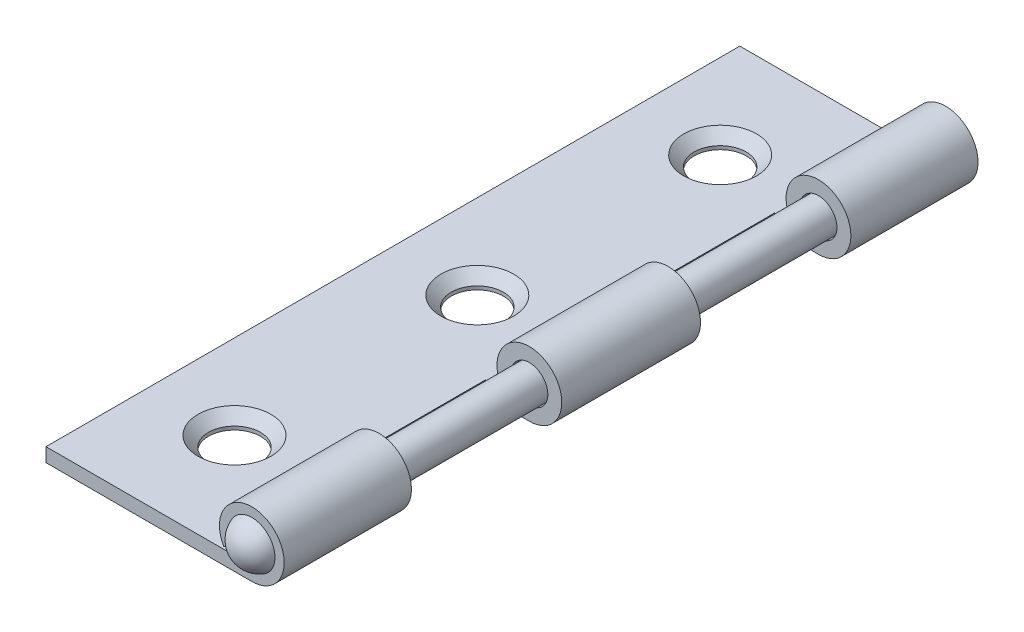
ISO-10303-21;
HEADER;
FILE_DESCRIPTION(('STEP AP214'),'2;1');
FILE_NAME('part.step','',(''),(''),'','','');
FILE_SCHEMA(('AUTOMOTIVE_DESIGN { 1 0 10303 214 1 1 1 1 }'));
ENDSEC;
DATA;
#1=APPLICATION_CONTEXT('core data for automotive mechanical design processes');
#2=APPLICATION_PROTOCOL_DEFINITION('international standard','automotive_design',2000,#1);
#3=PRODUCT_CONTEXT('',#1,'mechanical');
#4=PRODUCT('Part','Part','',(#3));
#5=PRODUCT_RELATED_PRODUCT_CATEGORY('part','',(#4));
#6=PRODUCT_DEFINITION_FORMATION('','',#4);
#7=PRODUCT_DEFINITION_CONTEXT('part definition',#1,'design');
#8=PRODUCT_DEFINITION('design','',#6,#7);
#9=PRODUCT_DEFINITION_SHAPE('','',#8);
#10=(LENGTH_UNIT() NAMED_UNIT(*) SI_UNIT(.MILLI.,.METRE.));
#11=(NAMED_UNIT(*) PLANE_ANGLE_UNIT() SI_UNIT($,.RADIAN.));
#12=(NAMED_UNIT(*) SI_UNIT($,.STERADIAN.) SOLID_ANGLE_UNIT());
#13=UNCERTAINTY_MEASURE_WITH_UNIT(LENGTH_MEASURE(1.E-05),#10,'distance_accuracy_value','');
#14=(GEOMETRIC_REPRESENTATION_CONTEXT(3) GLOBAL_UNCERTAINTY_ASSIGNED_CONTEXT((#13)) GLOBAL_UNIT_ASSIGNED_CONTEXT((#10,
#11,#12)) REPRESENTATION_CONTEXT('',''));
#15=CARTESIAN_POINT('',(0.,0.,0.));
#16=DIRECTION('',(0.,0.,1.));
#17=DIRECTION('',(1.,0.,0.));
#18=AXIS2_PLACEMENT_3D('',#15,#16,#17);
#19=CARTESIAN_POINT('',(0.,0.,-29.3456896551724));
#20=DIRECTION('',(0.,0.,-1.));
#21=DIRECTION('',(1.,0.,0.));
#22=AXIS2_PLACEMENT_3D('',#19,#20,#21);
#23=SPHERICAL_SURFACE('',#22,2.10431034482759);
#24=CARTESIAN_POINT('',(0.,0.,-30.));
#25=DIRECTION('',(0.,0.,-1.));
#26=DIRECTION('',(-1.,0.,0.));
#27=AXIS2_PLACEMENT_3D('',#24,#25,#26);
#28=CIRCLE('',#27,2.);
#29=CARTESIAN_POINT('',(-2.,0.,-30.));
#30=VERTEX_POINT('',#29);
#31=EDGE_CURVE('E11',#30,#30,#28,.T.);
#32=ORIENTED_EDGE('',*,*,#31,.T.);
#33=EDGE_LOOP('',(#32));
#34=FACE_BOUND('',#33,.T.);
#35=ADVANCED_FACE('F42',(#34),#23,.T.);
#36=CARTESIAN_POINT('',(-1.49999999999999,0.,-30.));
#37=DIRECTION('',(0.,0.,1.));
#38=DIRECTION('',(1.,0.,0.));
#39=AXIS2_PLACEMENT_3D('',#36,#37,#38);
#40=PLANE('',#39);
#41=CARTESIAN_POINT('',(0.,0.,-30.));
#42=DIRECTION('',(0.,0.,-1.));
#43=DIRECTION('',(-1.,0.,0.));
#44=AXIS2_PLACEMENT_3D('',#41,#42,#43);
#45=CIRCLE('',#44,1.49999999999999);
#46=CARTESIAN_POINT('',(-1.49999999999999,0.,-30.));
#47=VERTEX_POINT('',#46);
#48=EDGE_CURVE('E48',#47,#47,#45,.T.);
#49=ORIENTED_EDGE('',*,*,#48,.T.);
#50=EDGE_LOOP('',(#49));
#51=FACE_BOUND('',#50,.T.);
#52=ORIENTED_EDGE('',*,*,#31,.F.);
#53=EDGE_LOOP('',(#52));
#54=FACE_BOUND('',#53,.T.);
#55=ADVANCED_FACE('F74',(#51,#54),#40,.T.);
#56=CARTESIAN_POINT('',(0.,0.,-88.99));
#57=DIRECTION('',(0.,0.,-1.));
#58=DIRECTION('',(-1.,0.,0.));
#59=AXIS2_PLACEMENT_3D('',#56,#57,#58);
#60=CYLINDRICAL_SURFACE('',#59,1.49999999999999);
#61=CARTESIAN_POINT('',(0.,0.,30.));
#62=DIRECTION('',(0.,0.,-1.));
#63=DIRECTION('',(-1.,0.,0.));
#64=AXIS2_PLACEMENT_3D('',#61,#62,#63);
#65=CIRCLE('',#64,1.49999999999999);
#66=CARTESIAN_POINT('',(-1.49999999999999,0.,30.));
#67=VERTEX_POINT('',#66);
#68=EDGE_CURVE('E52',#67,#67,#65,.T.);
#69=ORIENTED_EDGE('',*,*,#68,.T.);
#70=EDGE_LOOP('',(#69));
#71=FACE_BOUND('',#70,.T.);
#72=ORIENTED_EDGE('',*,*,#48,.F.);
#73=EDGE_LOOP('',(#72));
#74=FACE_BOUND('',#73,.T.);
#75=ADVANCED_FACE('F71',(#71,#74),#60,.T.);
#76=CARTESIAN_POINT('',(-2.,0.,30.));
#77=DIRECTION('',(0.,0.,-1.));
#78=DIRECTION('',(-1.,0.,0.));
#79=AXIS2_PLACEMENT_3D('',#76,#77,#78);
#80=PLANE('',#79);
#81=CARTESIAN_POINT('',(0.,0.,30.));
#82=DIRECTION('',(0.,0.,-1.));
#83=DIRECTION('',(-1.,0.,0.));
#84=AXIS2_PLACEMENT_3D('',#81,#82,#83);
#85=CIRCLE('',#84,2.);
#86=CARTESIAN_POINT('',(-2.,0.,30.));
#87=VERTEX_POINT('',#86);
#88=EDGE_CURVE('E56',#87,#87,#85,.T.);
#89=ORIENTED_EDGE('',*,*,#88,.T.);
#90=EDGE_LOOP('',(#89));
#91=FACE_BOUND('',#90,.T.);
#92=ORIENTED_EDGE('',*,*,#68,.F.);
#93=EDGE_LOOP('',(#92));
#94=FACE_BOUND('',#93,.T.);
#95=ADVANCED_FACE('F62',(#91,#94),#80,.T.);
#96=CARTESIAN_POINT('',(0.,0.,29.3456896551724));
#97=DIRECTION('',(0.,0.,-1.));
#98=DIRECTION('',(-1.,0.,0.));
#99=AXIS2_PLACEMENT_3D('',#96,#97,#98);
#100=SPHERICAL_SURFACE('',#99,2.1043103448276);
#101=ORIENTED_EDGE('',*,*,#88,.F.);
#102=EDGE_LOOP('',(#101));
#103=FACE_BOUND('',#102,.T.);
#104=ADVANCED_FACE('F65',(#103),#100,.T.);
#105=CLOSED_SHELL('',(#35,#55,#75,#95,#104));
#106=MANIFOLD_SOLID_BREP('B2',#105);
#107=CARTESIAN_POINT('',(0.,0.,30.));
#108=DIRECTION('',(0.,0.,-1.));
#109=DIRECTION('',(-1.,0.,0.));
#110=AXIS2_PLACEMENT_3D('',#107,#108,#109);
#111=CYLINDRICAL_SURFACE('',#110,1.6);
#112=DIRECTION('',(0.,0.,-1.));
#113=VECTOR('',#112,1.);
#114=CARTESIAN_POINT('',(0.,-1.6,30.));
#115=LINE('',#114,#113);
#116=CARTESIAN_POINT('',(0.,-1.6,6.));
#117=VERTEX_POINT('',#116);
#118=CARTESIAN_POINT('',(0.,-1.6,-6.00000000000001));
#119=VERTEX_POINT('',#118);
#120=EDGE_CURVE('E369',#117,#119,#115,.T.);
#121=ORIENTED_EDGE('',*,*,#120,.F.);
#122=CARTESIAN_POINT('',(0.,0.,6.));
#123=DIRECTION('',(0.,0.,-1.));
#124=DIRECTION('',(-1.,0.,0.));
#125=AXIS2_PLACEMENT_3D('',#122,#123,#124);
#126=CIRCLE('',#125,1.6);
#127=CARTESIAN_POINT('',(-1.3856406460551,-0.800000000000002,6.));
#128=VERTEX_POINT('',#127);
#129=EDGE_CURVE('E265',#117,#128,#126,.F.);
#130=ORIENTED_EDGE('',*,*,#129,.T.);
#131=DIRECTION('',(0.,0.,-1.));
#132=VECTOR('',#131,1.);
#133=CARTESIAN_POINT('',(-1.3856406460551,-0.800000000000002,30.));
#134=LINE('',#133,#132);
#135=CARTESIAN_POINT('',(-1.3856406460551,-0.800000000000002,-6.00000000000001));
#136=VERTEX_POINT('',#135);
#137=EDGE_CURVE('E135',#128,#136,#134,.T.);
#138=ORIENTED_EDGE('',*,*,#137,.T.);
#139=CARTESIAN_POINT('',(0.,0.,-6.00000000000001));
#140=DIRECTION('',(0.,0.,1.));
#141=DIRECTION('',(1.,0.,0.));
#142=AXIS2_PLACEMENT_3D('',#139,#140,#141);
#143=CIRCLE('',#142,1.6);
#144=EDGE_CURVE('E288',#136,#119,#143,.F.);
#145=ORIENTED_EDGE('',*,*,#144,.T.);
#146=EDGE_LOOP('',(#121,#130,#138,#145));
#147=FACE_BOUND('',#146,.T.);
#148=ADVANCED_FACE('F112',(#147),#111,.F.);
#149=CARTESIAN_POINT('',(0.,0.,30.));
#150=DIRECTION('',(0.,0.,-1.));
#151=DIRECTION('',(-1.,0.,0.));
#152=AXIS2_PLACEMENT_3D('',#149,#150,#151);
#153=CYLINDRICAL_SURFACE('',#152,2.8);
#154=DIRECTION('',(0.,0.,-1.));
#155=VECTOR('',#154,1.);
#156=CARTESIAN_POINT('',(-2.42487113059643,-1.4,30.));
#157=LINE('',#156,#155);
#158=CARTESIAN_POINT('',(-2.42487113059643,-1.4,6.));
#159=VERTEX_POINT('',#158);
#160=CARTESIAN_POINT('',(-2.42487113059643,-1.4,-6.00000000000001));
#161=VERTEX_POINT('',#160);
#162=EDGE_CURVE('E355',#159,#161,#157,.T.);
#163=ORIENTED_EDGE('',*,*,#162,.F.);
#164=CARTESIAN_POINT('',(0.,0.,6.));
#165=DIRECTION('',(0.,0.,-1.));
#166=DIRECTION('',(-1.,0.,0.));
#167=AXIS2_PLACEMENT_3D('',#164,#165,#166);
#168=CIRCLE('',#167,2.8);
#169=CARTESIAN_POINT('',(0.,-2.8,6.));
#170=VERTEX_POINT('',#169);
#171=EDGE_CURVE('E266',#159,#170,#168,.T.);
#172=ORIENTED_EDGE('',*,*,#171,.T.);
#173=DIRECTION('',(0.,0.,-1.));
#174=VECTOR('',#173,1.);
#175=CARTESIAN_POINT('',(0.,-2.8,30.));
#176=LINE('',#175,#174);
#177=CARTESIAN_POINT('',(0.,-2.8,-6.00000000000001));
#178=VERTEX_POINT('',#177);
#179=EDGE_CURVE('E262',#170,#178,#176,.T.);
#180=ORIENTED_EDGE('',*,*,#179,.T.);
#181=CARTESIAN_POINT('',(0.,0.,-6.00000000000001));
#182=DIRECTION('',(0.,0.,1.));
#183=DIRECTION('',(1.,0.,0.));
#184=AXIS2_PLACEMENT_3D('',#181,#182,#183);
#185=CIRCLE('',#184,2.8);
#186=EDGE_CURVE('E281',#178,#161,#185,.T.);
#187=ORIENTED_EDGE('',*,*,#186,.T.);
#188=EDGE_LOOP('',(#163,#172,#180,#187));
#189=FACE_BOUND('',#188,.T.);
#190=ADVANCED_FACE('F403',(#189),#153,.T.);
#191=CARTESIAN_POINT('',(-1.3856406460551,-0.800000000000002,30.));
#192=DIRECTION('',(-0.500000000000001,0.866025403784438,0.));
#193=DIRECTION('',(-0.866025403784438,-0.500000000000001,0.));
#194=AXIS2_PLACEMENT_3D('',#191,#192,#193);
#195=PLANE('',#194);
#196=ORIENTED_EDGE('',*,*,#137,.F.);
#197=DIRECTION('',(-0.866025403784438,-0.500000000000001,0.));
#198=VECTOR('',#197,1.);
#199=CARTESIAN_POINT('',(-1.3856406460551,-0.800000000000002,6.));
#200=LINE('',#199,#198);
#201=EDGE_CURVE('E120',#128,#159,#200,.T.);
#202=ORIENTED_EDGE('',*,*,#201,.T.);
#203=ORIENTED_EDGE('',*,*,#162,.T.);
#204=DIRECTION('',(0.866025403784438,0.500000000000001,0.));
#205=VECTOR('',#204,1.);
#206=CARTESIAN_POINT('',(-1.3856406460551,-0.800000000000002,-6.00000000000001));
#207=LINE('',#206,#205);
#208=EDGE_CURVE('E387',#161,#136,#207,.T.);
#209=ORIENTED_EDGE('',*,*,#208,.T.);
#210=EDGE_LOOP('',(#196,#202,#203,#209));
#211=FACE_BOUND('',#210,.T.);
#212=ADVANCED_FACE('F400',(#211),#195,.F.);
#213=CARTESIAN_POINT('',(0.,-1.6,-19.));
#214=VERTEX_POINT('',#213);
#215=CARTESIAN_POINT('',(0.,-1.6,-30.));
#216=VERTEX_POINT('',#215);
#217=EDGE_CURVE('E364',#214,#216,#115,.T.);
#218=ORIENTED_EDGE('',*,*,#217,.F.);
#219=CARTESIAN_POINT('',(0.,0.,-19.));
#220=DIRECTION('',(0.,0.,-1.));
#221=DIRECTION('',(-1.,0.,0.));
#222=AXIS2_PLACEMENT_3D('',#219,#220,#221);
#223=CIRCLE('',#222,1.6);
#224=CARTESIAN_POINT('',(-1.3856406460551,-0.800000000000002,-19.));
#225=VERTEX_POINT('',#224);
#226=EDGE_CURVE('E299',#214,#225,#223,.F.);
#227=ORIENTED_EDGE('',*,*,#226,.T.);
#228=CARTESIAN_POINT('',(-1.3856406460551,-0.800000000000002,-30.));
#229=VERTEX_POINT('',#228);
#230=EDGE_CURVE('E332',#225,#229,#134,.T.);
#231=ORIENTED_EDGE('',*,*,#230,.T.);
#232=CARTESIAN_POINT('',(0.,0.,-30.));
#233=DIRECTION('',(0.,0.,-1.));
#234=DIRECTION('',(1.,0.,0.));
#235=AXIS2_PLACEMENT_3D('',#232,#233,#234);
#236=CIRCLE('',#235,1.6);
#237=EDGE_CURVE('E317',#229,#216,#236,.T.);
#238=ORIENTED_EDGE('',*,*,#237,.T.);
#239=EDGE_LOOP('',(#218,#227,#231,#238));
#240=FACE_BOUND('',#239,.T.);
#241=ADVANCED_FACE('F422',(#240),#111,.F.);
#242=CARTESIAN_POINT('',(-2.42487113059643,-1.4,-19.));
#243=VERTEX_POINT('',#242);
#244=CARTESIAN_POINT('',(-2.42487113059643,-1.4,-30.));
#245=VERTEX_POINT('',#244);
#246=EDGE_CURVE('E350',#243,#245,#157,.T.);
#247=ORIENTED_EDGE('',*,*,#246,.F.);
#248=CARTESIAN_POINT('',(0.,0.,-19.));
#249=DIRECTION('',(0.,0.,-1.));
#250=DIRECTION('',(-1.,0.,0.));
#251=AXIS2_PLACEMENT_3D('',#248,#249,#250);
#252=CIRCLE('',#251,2.8);
#253=CARTESIAN_POINT('',(0.,-2.8,-19.));
#254=VERTEX_POINT('',#253);
#255=EDGE_CURVE('E293',#243,#254,#252,.T.);
#256=ORIENTED_EDGE('',*,*,#255,.T.);
#257=CARTESIAN_POINT('',(0.,-2.8,-30.));
#258=VERTEX_POINT('',#257);
#259=EDGE_CURVE('E354',#254,#258,#176,.T.);
#260=ORIENTED_EDGE('',*,*,#259,.T.);
#261=CARTESIAN_POINT('',(0.,0.,-30.));
#262=DIRECTION('',(0.,0.,1.));
#263=DIRECTION('',(1.,0.,0.));
#264=AXIS2_PLACEMENT_3D('',#261,#262,#263);
#265=CIRCLE('',#264,2.8);
#266=EDGE_CURVE('E342',#258,#245,#265,.T.);
#267=ORIENTED_EDGE('',*,*,#266,.T.);
#268=EDGE_LOOP('',(#247,#256,#260,#267));
#269=FACE_BOUND('',#268,.T.);
#270=ADVANCED_FACE('F413',(#269),#153,.T.);
#271=ORIENTED_EDGE('',*,*,#230,.F.);
#272=DIRECTION('',(-0.866025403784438,-0.500000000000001,0.));
#273=VECTOR('',#272,1.);
#274=CARTESIAN_POINT('',(-1.3856406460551,-0.800000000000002,-19.));
#275=LINE('',#274,#273);
#276=EDGE_CURVE('E390',#225,#243,#275,.T.);
#277=ORIENTED_EDGE('',*,*,#276,.T.);
#278=ORIENTED_EDGE('',*,*,#246,.T.);
#279=DIRECTION('',(0.866025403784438,0.500000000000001,0.));
#280=VECTOR('',#279,1.);
#281=CARTESIAN_POINT('',(-1.3856406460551,-0.800000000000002,-30.));
#282=LINE('',#281,#280);
#283=EDGE_CURVE('E322',#245,#229,#282,.T.);
#284=ORIENTED_EDGE('',*,*,#283,.T.);
#285=EDGE_LOOP('',(#271,#277,#278,#284));
#286=FACE_BOUND('',#285,.T.);
#287=ADVANCED_FACE('F408',(#286),#195,.F.);
#288=CARTESIAN_POINT('',(-1.3856406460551,-0.800000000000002,30.));
#289=VERTEX_POINT('',#288);
#290=CARTESIAN_POINT('',(-1.3856406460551,-0.800000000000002,19.));
#291=VERTEX_POINT('',#290);
#292=EDGE_CURVE('E347',#289,#291,#134,.T.);
#293=ORIENTED_EDGE('',*,*,#292,.T.);
#294=CARTESIAN_POINT('',(0.,0.,19.));
#295=DIRECTION('',(0.,0.,1.));
#296=DIRECTION('',(1.,0.,0.));
#297=AXIS2_PLACEMENT_3D('',#294,#295,#296);
#298=CIRCLE('',#297,1.6);
#299=CARTESIAN_POINT('',(0.,-1.6,19.));
#300=VERTEX_POINT('',#299);
#301=EDGE_CURVE('E127',#291,#300,#298,.F.);
#302=ORIENTED_EDGE('',*,*,#301,.T.);
#303=CARTESIAN_POINT('',(0.,-1.6,30.));
#304=VERTEX_POINT('',#303);
#305=EDGE_CURVE('E365',#304,#300,#115,.T.);
#306=ORIENTED_EDGE('',*,*,#305,.F.);
#307=CARTESIAN_POINT('',(0.,0.,30.));
#308=DIRECTION('',(0.,0.,-1.));
#309=DIRECTION('',(1.,0.,0.));
#310=AXIS2_PLACEMENT_3D('',#307,#308,#309);
#311=CIRCLE('',#310,1.6);
#312=EDGE_CURVE('E318',#289,#304,#311,.T.);
#313=ORIENTED_EDGE('',*,*,#312,.F.);
#314=EDGE_LOOP('',(#293,#302,#306,#313));
#315=FACE_BOUND('',#314,.T.);
#316=ADVANCED_FACE('F447',(#315),#111,.F.);
#317=CARTESIAN_POINT('',(0.,-1.6,30.));
#318=DIRECTION('',(0.,-1.,0.));
#319=DIRECTION('',(1.,0.,0.));
#320=AXIS2_PLACEMENT_3D('',#317,#318,#319);
#321=PLANE('',#320);
#322=CARTESIAN_POINT('',(-10.5,-1.6,21.));
#323=DIRECTION('',(0.,-1.,0.));
#324=DIRECTION('',(1.,0.,0.));
#325=AXIS2_PLACEMENT_3D('',#322,#323,#324);
#326=CIRCLE('',#325,3.15000000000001);
#327=CARTESIAN_POINT('',(-7.34999999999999,-1.6,21.));
#328=VERTEX_POINT('',#327);
#329=EDGE_CURVE('E375',#328,#328,#326,.T.);
#330=ORIENTED_EDGE('',*,*,#329,.T.);
#331=EDGE_LOOP('',(#330));
#332=FACE_BOUND('',#331,.T.);
#333=CARTESIAN_POINT('',(-10.5,-1.6,0.));
#334=DIRECTION('',(0.,-1.,0.));
#335=DIRECTION('',(1.,0.,0.));
#336=AXIS2_PLACEMENT_3D('',#333,#334,#335);
#337=CIRCLE('',#336,3.15000000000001);
#338=CARTESIAN_POINT('',(-7.34999999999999,-1.6,0.));
#339=VERTEX_POINT('',#338);
#340=EDGE_CURVE('E372',#339,#339,#337,.T.);
#341=ORIENTED_EDGE('',*,*,#340,.T.);
#342=EDGE_LOOP('',(#341));
#343=FACE_BOUND('',#342,.T.);
#344=CARTESIAN_POINT('',(-10.5,-1.6,-21.));
#345=DIRECTION('',(0.,-1.,0.));
#346=DIRECTION('',(1.,0.,0.));
#347=AXIS2_PLACEMENT_3D('',#344,#345,#346);
#348=CIRCLE('',#347,3.15000000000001);
#349=CARTESIAN_POINT('',(-7.34999999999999,-1.6,-21.));
#350=VERTEX_POINT('',#349);
#351=EDGE_CURVE('E368',#350,#350,#348,.T.);
#352=ORIENTED_EDGE('',*,*,#351,.T.);
#353=EDGE_LOOP('',(#352));
#354=FACE_BOUND('',#353,.T.);
#355=DIRECTION('',(0.,0.,-1.));
#356=VECTOR('',#355,1.);
#357=CARTESIAN_POINT('',(-3.8,-1.6,30.));
#358=LINE('',#357,#356);
#359=CARTESIAN_POINT('',(-3.8,-1.6,19.));
#360=VERTEX_POINT('',#359);
#361=CARTESIAN_POINT('',(-3.8,-1.6,6.));
#362=VERTEX_POINT('',#361);
#363=EDGE_CURVE('E254',#360,#362,#358,.T.);
#364=ORIENTED_EDGE('',*,*,#363,.T.);
#365=DIRECTION('',(1.,0.,0.));
#366=VECTOR('',#365,1.);
#367=CARTESIAN_POINT('',(0.,-1.6,6.));
#368=LINE('',#367,#366);
#369=EDGE_CURVE('E268',#362,#117,#368,.T.);
#370=ORIENTED_EDGE('',*,*,#369,.T.);
#371=ORIENTED_EDGE('',*,*,#120,.T.);
#372=DIRECTION('',(-1.,0.,0.));
#373=VECTOR('',#372,1.);
#374=CARTESIAN_POINT('',(0.,-1.6,-6.00000000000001));
#375=LINE('',#374,#373);
#376=CARTESIAN_POINT('',(-3.8,-1.6,-6.));
#377=VERTEX_POINT('',#376);
#378=EDGE_CURVE('E290',#119,#377,#375,.T.);
#379=ORIENTED_EDGE('',*,*,#378,.T.);
#380=DIRECTION('',(0.,0.,-1.));
#381=VECTOR('',#380,1.);
#382=CARTESIAN_POINT('',(-3.8,-1.6,30.));
#383=LINE('',#382,#381);
#384=CARTESIAN_POINT('',(-3.8,-1.6,-19.));
#385=VERTEX_POINT('',#384);
#386=EDGE_CURVE('E305',#377,#385,#383,.T.);
#387=ORIENTED_EDGE('',*,*,#386,.T.);
#388=DIRECTION('',(1.,0.,0.));
#389=VECTOR('',#388,1.);
#390=CARTESIAN_POINT('',(0.,-1.6,-19.));
#391=LINE('',#390,#389);
#392=EDGE_CURVE('E302',#385,#214,#391,.T.);
#393=ORIENTED_EDGE('',*,*,#392,.T.);
#394=ORIENTED_EDGE('',*,*,#217,.T.);
#395=DIRECTION('',(-1.,0.,0.));
#396=VECTOR('',#395,1.);
#397=CARTESIAN_POINT('',(0.,-1.6,-30.));
#398=LINE('',#397,#396);
#399=CARTESIAN_POINT('',(-17.8,-1.6,-30.));
#400=VERTEX_POINT('',#399);
#401=EDGE_CURVE('E335',#216,#400,#398,.T.);
#402=ORIENTED_EDGE('',*,*,#401,.T.);
#403=DIRECTION('',(0.,0.,-1.));
#404=VECTOR('',#403,1.);
#405=CARTESIAN_POINT('',(-17.8,-1.6,30.));
#406=LINE('',#405,#404);
#407=CARTESIAN_POINT('',(-17.8,-1.6,30.));
#408=VERTEX_POINT('',#407);
#409=EDGE_CURVE('E361',#408,#400,#406,.T.);
#410=ORIENTED_EDGE('',*,*,#409,.F.);
#411=DIRECTION('',(-1.,0.,0.));
#412=VECTOR('',#411,1.);
#413=CARTESIAN_POINT('',(0.,-1.6,30.));
#414=LINE('',#413,#412);
#415=EDGE_CURVE('E321',#304,#408,#414,.T.);
#416=ORIENTED_EDGE('',*,*,#415,.F.);
#417=ORIENTED_EDGE('',*,*,#305,.T.);
#418=DIRECTION('',(-1.,0.,0.));
#419=VECTOR('',#418,1.);
#420=CARTESIAN_POINT('',(0.,-1.6,19.));
#421=LINE('',#420,#419);
#422=EDGE_CURVE('E270',#300,#360,#421,.T.);
#423=ORIENTED_EDGE('',*,*,#422,.T.);
#424=EDGE_LOOP('',(#364,#370,#371,#379,#387,#393,#394,#402,#410,#416,#417,#423));
#425=FACE_BOUND('',#424,.T.);
#426=ADVANCED_FACE('F427',(#332,#343,#354,#425),#321,.F.);
#427=CARTESIAN_POINT('',(-17.8,-2.8,30.));
#428=DIRECTION('',(1.,0.,0.));
#429=DIRECTION('',(0.,1.,0.));
#430=AXIS2_PLACEMENT_3D('',#427,#428,#429);
#431=PLANE('',#430);
#432=DIRECTION('',(0.,-1.,0.));
#433=VECTOR('',#432,1.);
#434=CARTESIAN_POINT('',(-17.8,-2.8,-30.));
#435=LINE('',#434,#433);
#436=CARTESIAN_POINT('',(-17.8,-2.8,-30.));
#437=VERTEX_POINT('',#436);
#438=EDGE_CURVE('E337',#400,#437,#435,.T.);
#439=ORIENTED_EDGE('',*,*,#438,.T.);
#440=DIRECTION('',(0.,0.,-1.));
#441=VECTOR('',#440,1.);
#442=CARTESIAN_POINT('',(-17.8,-2.8,30.));
#443=LINE('',#442,#441);
#444=CARTESIAN_POINT('',(-17.8,-2.8,30.));
#445=VERTEX_POINT('',#444);
#446=EDGE_CURVE('E358',#445,#437,#443,.T.);
#447=ORIENTED_EDGE('',*,*,#446,.F.);
#448=DIRECTION('',(0.,-1.,0.));
#449=VECTOR('',#448,1.);
#450=CARTESIAN_POINT('',(-17.8,-2.8,30.));
#451=LINE('',#450,#449);
#452=EDGE_CURVE('E324',#408,#445,#451,.T.);
#453=ORIENTED_EDGE('',*,*,#452,.F.);
#454=ORIENTED_EDGE('',*,*,#409,.T.);
#455=EDGE_LOOP('',(#439,#447,#453,#454));
#456=FACE_BOUND('',#455,.T.);
#457=ADVANCED_FACE('F437',(#456),#431,.F.);
#458=CARTESIAN_POINT('',(0.,-2.8,30.));
#459=DIRECTION('',(0.,1.,0.));
#460=DIRECTION('',(-1.,0.,0.));
#461=AXIS2_PLACEMENT_3D('',#458,#459,#460);
#462=PLANE('',#461);
#463=CARTESIAN_POINT('',(-10.5,-2.8,-21.));
#464=DIRECTION('',(0.,1.,0.));
#465=DIRECTION('',(0.,0.,1.));
#466=AXIS2_PLACEMENT_3D('',#463,#464,#465);
#467=CIRCLE('',#466,2.25);
#468=CARTESIAN_POINT('',(-10.5,-2.8,-18.75));
#469=VERTEX_POINT('',#468);
#470=EDGE_CURVE('E308',#469,#469,#467,.T.);
#471=ORIENTED_EDGE('',*,*,#470,.T.);
#472=EDGE_LOOP('',(#471));
#473=FACE_BOUND('',#472,.T.);
#474=CARTESIAN_POINT('',(-10.5,-2.8,21.));
#475=DIRECTION('',(0.,1.,0.));
#476=DIRECTION('',(0.,0.,1.));
#477=AXIS2_PLACEMENT_3D('',#474,#475,#476);
#478=CIRCLE('',#477,2.25);
#479=CARTESIAN_POINT('',(-10.5,-2.8,23.25));
#480=VERTEX_POINT('',#479);
#481=EDGE_CURVE('E311',#480,#480,#478,.T.);
#482=ORIENTED_EDGE('',*,*,#481,.T.);
#483=EDGE_LOOP('',(#482));
#484=FACE_BOUND('',#483,.T.);
#485=CARTESIAN_POINT('',(-10.5,-2.8,0.));
#486=DIRECTION('',(0.,1.,0.));
#487=DIRECTION('',(0.,0.,1.));
#488=AXIS2_PLACEMENT_3D('',#485,#486,#487);
#489=CIRCLE('',#488,2.25);
#490=CARTESIAN_POINT('',(-10.5,-2.8,2.25));
#491=VERTEX_POINT('',#490);
#492=EDGE_CURVE('E314',#491,#491,#489,.T.);
#493=ORIENTED_EDGE('',*,*,#492,.T.);
#494=EDGE_LOOP('',(#493));
#495=FACE_BOUND('',#494,.T.);
#496=ORIENTED_EDGE('',*,*,#179,.F.);
#497=DIRECTION('',(-1.,0.,0.));
#498=VECTOR('',#497,1.);
#499=CARTESIAN_POINT('',(0.,-2.8,6.));
#500=LINE('',#499,#498);
#501=CARTESIAN_POINT('',(-3.8,-2.8,6.));
#502=VERTEX_POINT('',#501);
#503=EDGE_CURVE('E260',#170,#502,#500,.T.);
#504=ORIENTED_EDGE('',*,*,#503,.T.);
#505=DIRECTION('',(0.,0.,1.));
#506=VECTOR('',#505,1.);
#507=CARTESIAN_POINT('',(-3.8,-2.8,30.));
#508=LINE('',#507,#506);
#509=CARTESIAN_POINT('',(-3.8,-2.8,19.));
#510=VERTEX_POINT('',#509);
#511=EDGE_CURVE('E40',#502,#510,#508,.T.);
#512=ORIENTED_EDGE('',*,*,#511,.T.);
#513=DIRECTION('',(1.,0.,0.));
#514=VECTOR('',#513,1.);
#515=CARTESIAN_POINT('',(0.,-2.8,19.));
#516=LINE('',#515,#514);
#517=CARTESIAN_POINT('',(0.,-2.8,19.));
#518=VERTEX_POINT('',#517);
#519=EDGE_CURVE('E238',#510,#518,#516,.T.);
#520=ORIENTED_EDGE('',*,*,#519,.T.);
#521=CARTESIAN_POINT('',(0.,-2.8,30.));
#522=VERTEX_POINT('',#521);
#523=EDGE_CURVE('E356',#522,#518,#176,.T.);
#524=ORIENTED_EDGE('',*,*,#523,.F.);
#525=DIRECTION('',(1.,0.,0.));
#526=VECTOR('',#525,1.);
#527=CARTESIAN_POINT('',(0.,-2.8,30.));
#528=LINE('',#527,#526);
#529=EDGE_CURVE('E326',#445,#522,#528,.T.);
#530=ORIENTED_EDGE('',*,*,#529,.F.);
#531=ORIENTED_EDGE('',*,*,#446,.T.);
#532=DIRECTION('',(1.,0.,0.));
#533=VECTOR('',#532,1.);
#534=CARTESIAN_POINT('',(0.,-2.8,-30.));
#535=LINE('',#534,#533);
#536=EDGE_CURVE('E339',#437,#258,#535,.T.);
#537=ORIENTED_EDGE('',*,*,#536,.T.);
#538=ORIENTED_EDGE('',*,*,#259,.F.);
#539=DIRECTION('',(-1.,0.,0.));
#540=VECTOR('',#539,1.);
#541=CARTESIAN_POINT('',(0.,-2.8,-19.));
#542=LINE('',#541,#540);
#543=CARTESIAN_POINT('',(-3.8,-2.8,-19.));
#544=VERTEX_POINT('',#543);
#545=EDGE_CURVE('E296',#254,#544,#542,.T.);
#546=ORIENTED_EDGE('',*,*,#545,.T.);
#547=DIRECTION('',(0.,0.,1.));
#548=VECTOR('',#547,1.);
#549=CARTESIAN_POINT('',(-3.8,-2.8,30.));
#550=LINE('',#549,#548);
#551=CARTESIAN_POINT('',(-3.8,-2.8,-6.));
#552=VERTEX_POINT('',#551);
#553=EDGE_CURVE('E393',#544,#552,#550,.T.);
#554=ORIENTED_EDGE('',*,*,#553,.T.);
#555=DIRECTION('',(1.,0.,0.));
#556=VECTOR('',#555,1.);
#557=CARTESIAN_POINT('',(0.,-2.8,-6.00000000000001));
#558=LINE('',#557,#556);
#559=EDGE_CURVE('E286',#552,#178,#558,.T.);
#560=ORIENTED_EDGE('',*,*,#559,.T.);
#561=EDGE_LOOP('',(#496,#504,#512,#520,#524,#530,#531,#537,#538,#546,#554,#560));
#562=FACE_BOUND('',#561,.T.);
#563=ADVANCED_FACE('F259',(#473,#484,#495,#562),#462,.F.);
#564=ORIENTED_EDGE('',*,*,#523,.T.);
#565=CARTESIAN_POINT('',(0.,0.,19.));
#566=DIRECTION('',(0.,0.,1.));
#567=DIRECTION('',(1.,0.,0.));
#568=AXIS2_PLACEMENT_3D('',#565,#566,#567);
#569=CIRCLE('',#568,2.8);
#570=CARTESIAN_POINT('',(-2.42487113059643,-1.4,19.));
#571=VERTEX_POINT('',#570);
#572=EDGE_CURVE('E244',#518,#571,#569,.T.);
#573=ORIENTED_EDGE('',*,*,#572,.T.);
#574=CARTESIAN_POINT('',(-2.42487113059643,-1.4,30.));
#575=VERTEX_POINT('',#574);
#576=EDGE_CURVE('E351',#575,#571,#157,.T.);
#577=ORIENTED_EDGE('',*,*,#576,.F.);
#578=CARTESIAN_POINT('',(0.,0.,30.));
#579=DIRECTION('',(0.,0.,1.));
#580=DIRECTION('',(1.,0.,0.));
#581=AXIS2_PLACEMENT_3D('',#578,#579,#580);
#582=CIRCLE('',#581,2.8);
#583=EDGE_CURVE('E328',#522,#575,#582,.T.);
#584=ORIENTED_EDGE('',*,*,#583,.F.);
#585=EDGE_LOOP('',(#564,#573,#577,#584));
#586=FACE_BOUND('',#585,.T.);
#587=ADVANCED_FACE('F467',(#586),#153,.T.);
#588=ORIENTED_EDGE('',*,*,#576,.T.);
#589=DIRECTION('',(0.866025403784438,0.500000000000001,0.));
#590=VECTOR('',#589,1.);
#591=CARTESIAN_POINT('',(-1.3856406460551,-0.800000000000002,19.));
#592=LINE('',#591,#590);
#593=EDGE_CURVE('E396',#571,#291,#592,.T.);
#594=ORIENTED_EDGE('',*,*,#593,.T.);
#595=ORIENTED_EDGE('',*,*,#292,.F.);
#596=DIRECTION('',(0.866025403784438,0.500000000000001,0.));
#597=VECTOR('',#596,1.);
#598=CARTESIAN_POINT('',(-1.3856406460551,-0.800000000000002,30.));
#599=LINE('',#598,#597);
#600=EDGE_CURVE('E330',#575,#289,#599,.T.);
#601=ORIENTED_EDGE('',*,*,#600,.F.);
#602=EDGE_LOOP('',(#588,#594,#595,#601));
#603=FACE_BOUND('',#602,.T.);
#604=ADVANCED_FACE('F478',(#603),#195,.F.);
#605=CARTESIAN_POINT('',(0.,0.,30.));
#606=DIRECTION('',(0.,0.,1.));
#607=DIRECTION('',(1.,0.,0.));
#608=AXIS2_PLACEMENT_3D('',#605,#606,#607);
#609=PLANE('',#608);
#610=ORIENTED_EDGE('',*,*,#312,.T.);
#611=ORIENTED_EDGE('',*,*,#415,.T.);
#612=ORIENTED_EDGE('',*,*,#452,.T.);
#613=ORIENTED_EDGE('',*,*,#529,.T.);
#614=ORIENTED_EDGE('',*,*,#583,.T.);
#615=ORIENTED_EDGE('',*,*,#600,.T.);
#616=EDGE_LOOP('',(#610,#611,#612,#613,#614,#615));
#617=FACE_BOUND('',#616,.T.);
#618=ADVANCED_FACE('F443',(#617),#609,.T.);
#619=CARTESIAN_POINT('',(0.,0.,-30.));
#620=DIRECTION('',(0.,0.,1.));
#621=DIRECTION('',(1.,0.,0.));
#622=AXIS2_PLACEMENT_3D('',#619,#620,#621);
#623=PLANE('',#622);
#624=ORIENTED_EDGE('',*,*,#237,.F.);
#625=ORIENTED_EDGE('',*,*,#283,.F.);
#626=ORIENTED_EDGE('',*,*,#266,.F.);
#627=ORIENTED_EDGE('',*,*,#536,.F.);
#628=ORIENTED_EDGE('',*,*,#438,.F.);
#629=ORIENTED_EDGE('',*,*,#401,.F.);
#630=EDGE_LOOP('',(#624,#625,#626,#627,#628,#629));
#631=FACE_BOUND('',#630,.T.);
#632=ADVANCED_FACE('F417',(#631),#623,.F.);
#633=CARTESIAN_POINT('',(-10.5,-2.8,0.));
#634=DIRECTION('',(0.,1.,0.));
#635=DIRECTION('',(0.,0.,1.));
#636=AXIS2_PLACEMENT_3D('',#633,#634,#635);
#637=CYLINDRICAL_SURFACE('',#636,2.25);
#638=CARTESIAN_POINT('',(-10.5,-2.50000000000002,0.));
#639=DIRECTION('',(0.,-1.,0.));
#640=DIRECTION('',(0.,0.,-1.));
#641=AXIS2_PLACEMENT_3D('',#638,#639,#640);
#642=CIRCLE('',#641,2.25);
#643=CARTESIAN_POINT('',(-10.5,-2.50000000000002,-2.25));
#644=VERTEX_POINT('',#643);
#645=EDGE_CURVE('E381',#644,#644,#642,.F.);
#646=ORIENTED_EDGE('',*,*,#645,.T.);
#647=EDGE_LOOP('',(#646));
#648=FACE_BOUND('',#647,.T.);
#649=ORIENTED_EDGE('',*,*,#492,.F.);
#650=EDGE_LOOP('',(#649));
#651=FACE_BOUND('',#650,.T.);
#652=ADVANCED_FACE('F595',(#648,#651),#637,.F.);
#653=CARTESIAN_POINT('',(-10.5,-2.8,21.));
#654=DIRECTION('',(0.,1.,0.));
#655=DIRECTION('',(0.,0.,1.));
#656=AXIS2_PLACEMENT_3D('',#653,#654,#655);
#657=CYLINDRICAL_SURFACE('',#656,2.25);
#658=CARTESIAN_POINT('',(-10.5,-2.50000000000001,21.));
#659=DIRECTION('',(0.,-1.,0.));
#660=DIRECTION('',(0.,0.,-1.));
#661=AXIS2_PLACEMENT_3D('',#658,#659,#660);
#662=CIRCLE('',#661,2.25);
#663=CARTESIAN_POINT('',(-10.5,-2.50000000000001,18.75));
#664=VERTEX_POINT('',#663);
#665=EDGE_CURVE('E378',#664,#664,#662,.F.);
#666=ORIENTED_EDGE('',*,*,#665,.T.);
#667=EDGE_LOOP('',(#666));
#668=FACE_BOUND('',#667,.T.);
#669=ORIENTED_EDGE('',*,*,#481,.F.);
#670=EDGE_LOOP('',(#669));
#671=FACE_BOUND('',#670,.T.);
#672=ADVANCED_FACE('F591',(#668,#671),#657,.F.);
#673=CARTESIAN_POINT('',(-10.5,-2.8,-21.));
#674=DIRECTION('',(0.,1.,0.));
#675=DIRECTION('',(0.,0.,1.));
#676=AXIS2_PLACEMENT_3D('',#673,#674,#675);
#677=CYLINDRICAL_SURFACE('',#676,2.25);
#678=CARTESIAN_POINT('',(-10.5,-2.50000000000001,-21.));
#679=DIRECTION('',(0.,-1.,0.));
#680=DIRECTION('',(0.,0.,-1.));
#681=AXIS2_PLACEMENT_3D('',#678,#679,#680);
#682=CIRCLE('',#681,2.25);
#683=CARTESIAN_POINT('',(-10.5,-2.50000000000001,-23.25));
#684=VERTEX_POINT('',#683);
#685=EDGE_CURVE('E384',#684,#684,#682,.F.);
#686=ORIENTED_EDGE('',*,*,#685,.T.);
#687=EDGE_LOOP('',(#686));
#688=FACE_BOUND('',#687,.T.);
#689=ORIENTED_EDGE('',*,*,#470,.F.);
#690=EDGE_LOOP('',(#689));
#691=FACE_BOUND('',#690,.T.);
#692=ADVANCED_FACE('F587',(#688,#691),#677,.F.);
#693=CARTESIAN_POINT('',(-10.5,-1.6,21.));
#694=DIRECTION('',(0.,1.,0.));
#695=DIRECTION('',(0.,0.,1.));
#696=AXIS2_PLACEMENT_3D('',#693,#694,#695);
#697=CONICAL_SURFACE('',#696,3.15000000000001,0.785398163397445);
#698=ORIENTED_EDGE('',*,*,#665,.F.);
#699=EDGE_LOOP('',(#698));
#700=FACE_BOUND('',#699,.T.);
#701=ORIENTED_EDGE('',*,*,#329,.F.);
#702=EDGE_LOOP('',(#701));
#703=FACE_BOUND('',#702,.T.);
#704=ADVANCED_FACE('F590',(#700,#703),#697,.F.);
#705=CARTESIAN_POINT('',(-10.5,-1.6,0.));
#706=DIRECTION('',(0.,1.,0.));
#707=DIRECTION('',(0.,0.,1.));
#708=AXIS2_PLACEMENT_3D('',#705,#706,#707);
#709=CONICAL_SURFACE('',#708,3.15000000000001,0.785398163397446);
#710=ORIENTED_EDGE('',*,*,#645,.F.);
#711=EDGE_LOOP('',(#710));
#712=FACE_BOUND('',#711,.T.);
#713=ORIENTED_EDGE('',*,*,#340,.F.);
#714=EDGE_LOOP('',(#713));
#715=FACE_BOUND('',#714,.T.);
#716=ADVANCED_FACE('F623',(#712,#715),#709,.F.);
#717=CARTESIAN_POINT('',(-10.5,-1.6,-21.));
#718=DIRECTION('',(0.,1.,0.));
#719=DIRECTION('',(0.,0.,1.));
#720=AXIS2_PLACEMENT_3D('',#717,#718,#719);
#721=CONICAL_SURFACE('',#720,3.15000000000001,0.785398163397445);
#722=ORIENTED_EDGE('',*,*,#685,.F.);
#723=EDGE_LOOP('',(#722));
#724=FACE_BOUND('',#723,.T.);
#725=ORIENTED_EDGE('',*,*,#351,.F.);
#726=EDGE_LOOP('',(#725));
#727=FACE_BOUND('',#726,.T.);
#728=ADVANCED_FACE('F114',(#724,#727),#721,.F.);
#729=CARTESIAN_POINT('',(-3.8,-3.5,-19.));
#730=DIRECTION('',(-1.,0.,0.));
#731=DIRECTION('',(0.,0.,1.));
#732=AXIS2_PLACEMENT_3D('',#729,#730,#731);
#733=PLANE('',#732);
#734=DIRECTION('',(0.,1.,0.));
#735=VECTOR('',#734,1.);
#736=CARTESIAN_POINT('',(-3.8,-3.5,-6.));
#737=LINE('',#736,#735);
#738=EDGE_CURVE('E277',#552,#377,#737,.T.);
#739=ORIENTED_EDGE('',*,*,#738,.F.);
#740=ORIENTED_EDGE('',*,*,#553,.F.);
#741=DIRECTION('',(0.,1.,0.));
#742=VECTOR('',#741,1.);
#743=CARTESIAN_POINT('',(-3.8,-3.5,-19.));
#744=LINE('',#743,#742);
#745=EDGE_CURVE('E278',#544,#385,#744,.T.);
#746=ORIENTED_EDGE('',*,*,#745,.T.);
#747=ORIENTED_EDGE('',*,*,#386,.F.);
#748=EDGE_LOOP('',(#739,#740,#746,#747));
#749=FACE_BOUND('',#748,.T.);
#750=ADVANCED_FACE('F431',(#749),#733,.F.);
#751=CARTESIAN_POINT('',(-3.8,-3.5,-19.));
#752=DIRECTION('',(0.,0.,-1.));
#753=DIRECTION('',(-1.,0.,0.));
#754=AXIS2_PLACEMENT_3D('',#751,#752,#753);
#755=PLANE('',#754);
#756=ORIENTED_EDGE('',*,*,#745,.F.);
#757=ORIENTED_EDGE('',*,*,#545,.F.);
#758=ORIENTED_EDGE('',*,*,#255,.F.);
#759=ORIENTED_EDGE('',*,*,#276,.F.);
#760=ORIENTED_EDGE('',*,*,#226,.F.);
#761=ORIENTED_EDGE('',*,*,#392,.F.);
#762=EDGE_LOOP('',(#756,#757,#758,#759,#760,#761));
#763=FACE_BOUND('',#762,.T.);
#764=ADVANCED_FACE('F425',(#763),#755,.F.);
#765=CARTESIAN_POINT('',(-3.8,-3.5,-6.));
#766=DIRECTION('',(0.,0.,1.));
#767=DIRECTION('',(1.,0.,0.));
#768=AXIS2_PLACEMENT_3D('',#765,#766,#767);
#769=PLANE('',#768);
#770=ORIENTED_EDGE('',*,*,#144,.F.);
#771=ORIENTED_EDGE('',*,*,#208,.F.);
#772=ORIENTED_EDGE('',*,*,#186,.F.);
#773=ORIENTED_EDGE('',*,*,#559,.F.);
#774=ORIENTED_EDGE('',*,*,#738,.T.);
#775=ORIENTED_EDGE('',*,*,#378,.F.);
#776=EDGE_LOOP('',(#770,#771,#772,#773,#774,#775));
#777=FACE_BOUND('',#776,.T.);
#778=ADVANCED_FACE('F433',(#777),#769,.F.);
#779=CARTESIAN_POINT('',(-3.8,-3.5,6.));
#780=DIRECTION('',(-1.,0.,0.));
#781=DIRECTION('',(0.,0.,1.));
#782=AXIS2_PLACEMENT_3D('',#779,#780,#781);
#783=PLANE('',#782);
#784=DIRECTION('',(0.,1.,0.));
#785=VECTOR('',#784,1.);
#786=CARTESIAN_POINT('',(-3.8,-3.5,19.));
#787=LINE('',#786,#785);
#788=EDGE_CURVE('E241',#510,#360,#787,.T.);
#789=ORIENTED_EDGE('',*,*,#788,.F.);
#790=ORIENTED_EDGE('',*,*,#511,.F.);
#791=DIRECTION('',(0.,1.,0.));
#792=VECTOR('',#791,1.);
#793=CARTESIAN_POINT('',(-3.8,-3.5,6.));
#794=LINE('',#793,#792);
#795=EDGE_CURVE('E255',#502,#362,#794,.T.);
#796=ORIENTED_EDGE('',*,*,#795,.T.);
#797=ORIENTED_EDGE('',*,*,#363,.F.);
#798=EDGE_LOOP('',(#789,#790,#796,#797));
#799=FACE_BOUND('',#798,.T.);
#800=ADVANCED_FACE('F250',(#799),#783,.F.);
#801=CARTESIAN_POINT('',(-3.8,-3.5,6.));
#802=DIRECTION('',(0.,0.,-1.));
#803=DIRECTION('',(-1.,0.,0.));
#804=AXIS2_PLACEMENT_3D('',#801,#802,#803);
#805=PLANE('',#804);
#806=ORIENTED_EDGE('',*,*,#795,.F.);
#807=ORIENTED_EDGE('',*,*,#503,.F.);
#808=ORIENTED_EDGE('',*,*,#171,.F.);
#809=ORIENTED_EDGE('',*,*,#201,.F.);
#810=ORIENTED_EDGE('',*,*,#129,.F.);
#811=ORIENTED_EDGE('',*,*,#369,.F.);
#812=EDGE_LOOP('',(#806,#807,#808,#809,#810,#811));
#813=FACE_BOUND('',#812,.T.);
#814=ADVANCED_FACE('F452',(#813),#805,.F.);
#815=CARTESIAN_POINT('',(-3.8,-3.5,19.));
#816=DIRECTION('',(0.,0.,1.));
#817=DIRECTION('',(1.,0.,0.));
#818=AXIS2_PLACEMENT_3D('',#815,#816,#817);
#819=PLANE('',#818);
#820=ORIENTED_EDGE('',*,*,#301,.F.);
#821=ORIENTED_EDGE('',*,*,#593,.F.);
#822=ORIENTED_EDGE('',*,*,#572,.F.);
#823=ORIENTED_EDGE('',*,*,#519,.F.);
#824=ORIENTED_EDGE('',*,*,#788,.T.);
#825=ORIENTED_EDGE('',*,*,#422,.F.);
#826=EDGE_LOOP('',(#820,#821,#822,#823,#824,#825));
#827=FACE_BOUND('',#826,.T.);
#828=ADVANCED_FACE('F240',(#827),#819,.F.);
#829=CLOSED_SHELL('',(#148,#190,#212,#241,#270,#287,#316,#426,#457,#563,#587,#604,#618,#632,
#652,#672,#692,#704,#716,#728,#750,#764,#778,#800,#814,#828));
#830=MANIFOLD_SOLID_BREP('B6',#829);
#831=ADVANCED_BREP_SHAPE_REPRESENTATION('',(#18,#106,#830),#14);
#832=SHAPE_DEFINITION_REPRESENTATION(#9,#831);
ENDSEC;
END-ISO-10303-21;
